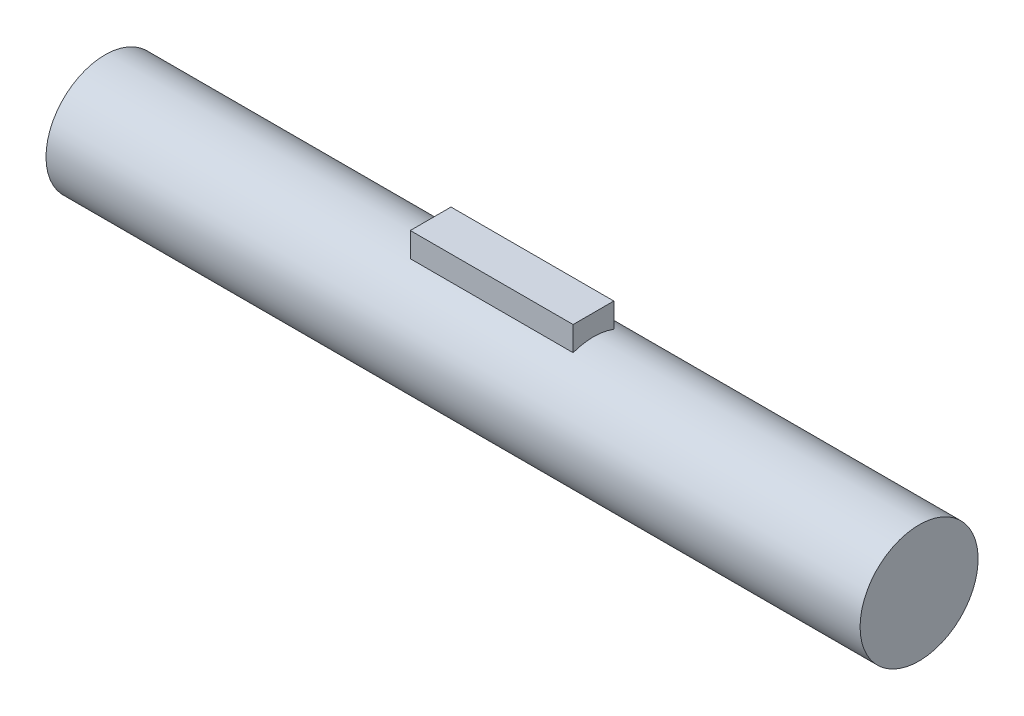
from build123d import *

# Parameters (mm, degrees)
EXTRUDE_1_DEPTH = 2
SKETCH_2_R      = 1.45
EXTRUDE_2_DEPTH = 8


with BuildPart() as part:
    # Sketch 1 → Extrude 1 (new, symmetric)
    with BuildSketch(Plane(origin=(0, 0, 0), x_dir=(0, 0, -1), z_dir=(1, 0, 0))):
        with BuildLine():
            Line((0.5, 1.961065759), (-0.5, 1.961065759))
            Line((-0.5, 1.961065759), (-0.5, 1.361065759))
            ThreePointArc((-0.5, 1.361065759), (0, -1.45), (0.5, 1.361065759))
            Line((0.5, 1.361065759), (0.5, 1.961065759))
        make_face()
    extrude(amount=EXTRUDE_1_DEPTH, both=True)

    # Sketch 2 → Extrude 2 (add)
    with BuildSketch(Plane.ZY.offset(2)):
        Circle(SKETCH_2_R)
    extrude_2 = extrude(amount=EXTRUDE_2_DEPTH)

    # Mirror 1: Extrude 2 across plane
    add(extrude_2.mirror(Plane(origin=(0, 0, 0), x_dir=(0, 0, 1), z_dir=(1, 0, 0))))


solid = part.part
